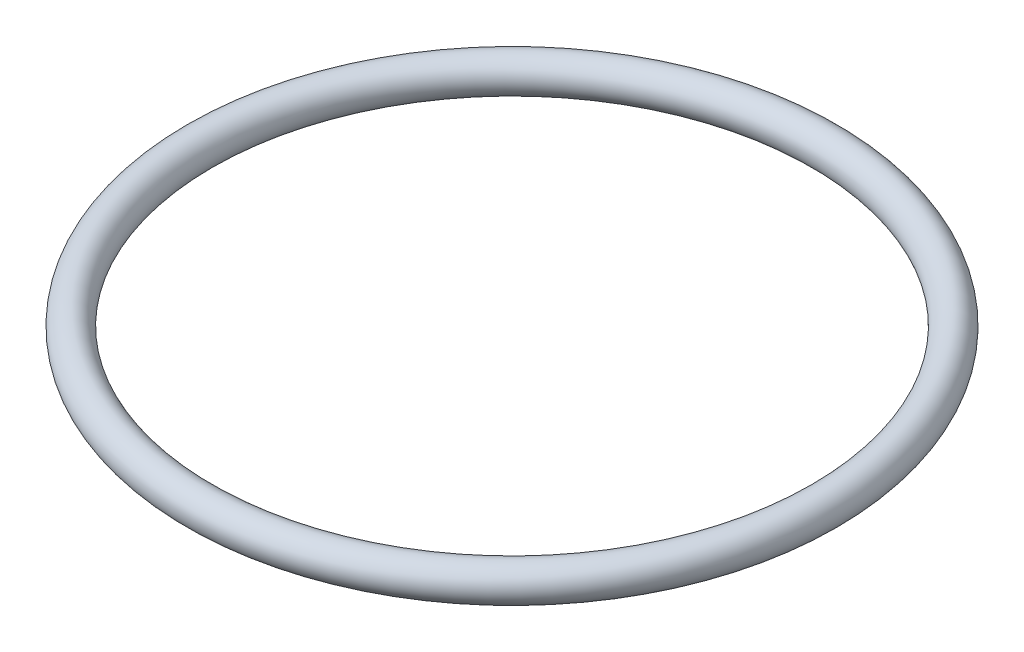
ISO-10303-21;
HEADER;
FILE_DESCRIPTION(('STEP AP214'),'2;1');
FILE_NAME('part.step','',(''),(''),'','','');
FILE_SCHEMA(('AUTOMOTIVE_DESIGN { 1 0 10303 214 1 1 1 1 }'));
ENDSEC;
DATA;
#1=APPLICATION_CONTEXT('core data for automotive mechanical design processes');
#2=APPLICATION_PROTOCOL_DEFINITION('international standard','automotive_design',2000,#1);
#3=PRODUCT_CONTEXT('',#1,'mechanical');
#4=PRODUCT('Part','Part','',(#3));
#5=PRODUCT_RELATED_PRODUCT_CATEGORY('part','',(#4));
#6=PRODUCT_DEFINITION_FORMATION('','',#4);
#7=PRODUCT_DEFINITION_CONTEXT('part definition',#1,'design');
#8=PRODUCT_DEFINITION('design','',#6,#7);
#9=PRODUCT_DEFINITION_SHAPE('','',#8);
#10=(LENGTH_UNIT() NAMED_UNIT(*) SI_UNIT(.MILLI.,.METRE.));
#11=(NAMED_UNIT(*) PLANE_ANGLE_UNIT() SI_UNIT($,.RADIAN.));
#12=(NAMED_UNIT(*) SI_UNIT($,.STERADIAN.) SOLID_ANGLE_UNIT());
#13=UNCERTAINTY_MEASURE_WITH_UNIT(LENGTH_MEASURE(1.E-05),#10,'distance_accuracy_value','');
#14=(GEOMETRIC_REPRESENTATION_CONTEXT(3) GLOBAL_UNCERTAINTY_ASSIGNED_CONTEXT((#13)) GLOBAL_UNIT_ASSIGNED_CONTEXT((#10,
#11,#12)) REPRESENTATION_CONTEXT('',''));
#15=CARTESIAN_POINT('',(0.,0.,0.));
#16=DIRECTION('',(0.,0.,1.));
#17=DIRECTION('',(1.,0.,0.));
#18=AXIS2_PLACEMENT_3D('',#15,#16,#17);
#19=CARTESIAN_POINT('',(0.,64.29,0.));
#20=DIRECTION('',(0.,-1.,0.));
#21=DIRECTION('',(1.,0.,0.));
#22=AXIS2_PLACEMENT_3D('',#19,#20,#21);
#23=TOROIDAL_SURFACE('',#22,15.825,0.890000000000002);
#24=CARTESIAN_POINT('',(16.715,64.29,0.));
#25=VERTEX_POINT('',#24);
#26=VERTEX_LOOP('',#25);
#27=FACE_BOUND('',#26,.T.);
#28=ADVANCED_FACE('F28',(#27),#23,.T.);
#29=CLOSED_SHELL('',(#28));
#30=MANIFOLD_SOLID_BREP('B2',#29);
#31=ADVANCED_BREP_SHAPE_REPRESENTATION('',(#18,#30),#14);
#32=SHAPE_DEFINITION_REPRESENTATION(#9,#31);
ENDSEC;
END-ISO-10303-21;
